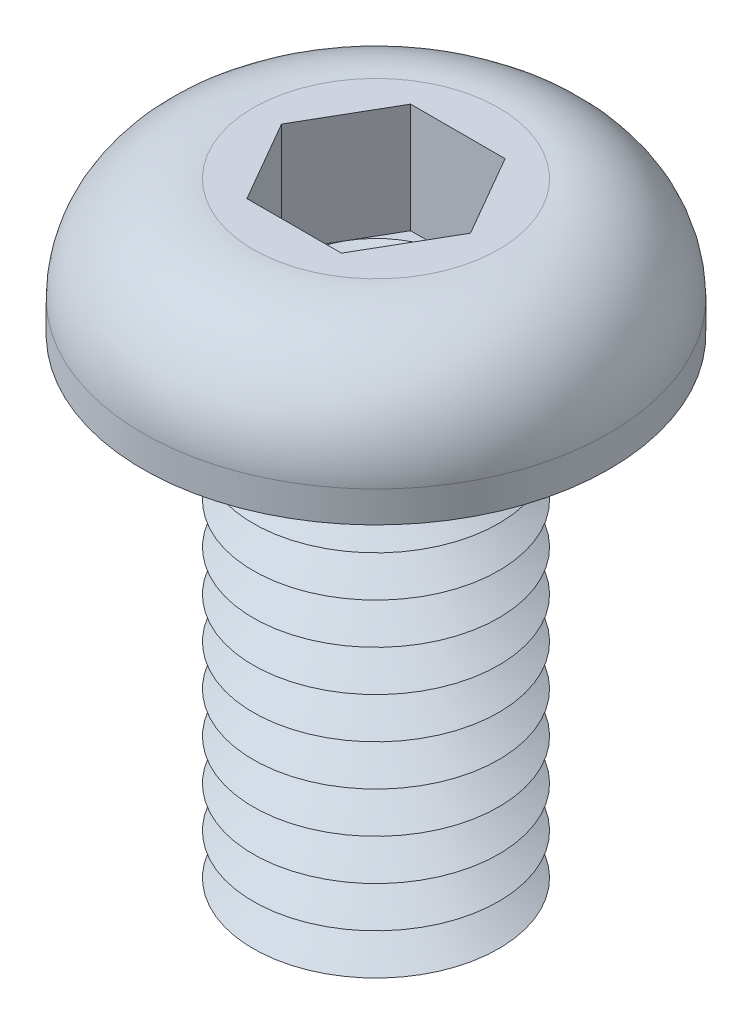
ISO-10303-21;
HEADER;
FILE_DESCRIPTION(('STEP AP214'),'2;1');
FILE_NAME('part.step','',(''),(''),'','','');
FILE_SCHEMA(('AUTOMOTIVE_DESIGN { 1 0 10303 214 1 1 1 1 }'));
ENDSEC;
DATA;
#1=APPLICATION_CONTEXT('core data for automotive mechanical design processes');
#2=APPLICATION_PROTOCOL_DEFINITION('international standard','automotive_design',2000,#1);
#3=PRODUCT_CONTEXT('',#1,'mechanical');
#4=PRODUCT('Part','Part','',(#3));
#5=PRODUCT_RELATED_PRODUCT_CATEGORY('part','',(#4));
#6=PRODUCT_DEFINITION_FORMATION('','',#4);
#7=PRODUCT_DEFINITION_CONTEXT('part definition',#1,'design');
#8=PRODUCT_DEFINITION('design','',#6,#7);
#9=PRODUCT_DEFINITION_SHAPE('','',#8);
#10=(LENGTH_UNIT() NAMED_UNIT(*) SI_UNIT(.MILLI.,.METRE.));
#11=(NAMED_UNIT(*) PLANE_ANGLE_UNIT() SI_UNIT($,.RADIAN.));
#12=(NAMED_UNIT(*) SI_UNIT($,.STERADIAN.) SOLID_ANGLE_UNIT());
#13=UNCERTAINTY_MEASURE_WITH_UNIT(LENGTH_MEASURE(1.E-05),#10,'distance_accuracy_value','');
#14=(GEOMETRIC_REPRESENTATION_CONTEXT(3) GLOBAL_UNCERTAINTY_ASSIGNED_CONTEXT((#13)) GLOBAL_UNIT_ASSIGNED_CONTEXT((#10,
#11,#12)) REPRESENTATION_CONTEXT('',''));
#15=CARTESIAN_POINT('',(0.,0.,0.));
#16=DIRECTION('',(0.,0.,1.));
#17=DIRECTION('',(1.,0.,0.));
#18=AXIS2_PLACEMENT_3D('',#15,#16,#17);
#19=CARTESIAN_POINT('',(0.,0.,0.));
#20=DIRECTION('',(0.,-1.,0.));
#21=DIRECTION('',(0.,0.,-1.));
#22=AXIS2_PLACEMENT_3D('',#19,#20,#21);
#23=TOROIDAL_SURFACE('',#22,1.75,0.25);
#24=CARTESIAN_POINT('',(0.,0.,-2.));
#25=VERTEX_POINT('',#24);
#26=VERTEX_LOOP('',#25);
#27=FACE_BOUND('',#26,.T.);
#28=ADVANCED_FACE('P0_F12',(#27),#23,.T.);
#29=CLOSED_SHELL('',(#28));
#30=MANIFOLD_SOLID_BREP('P0_B1',#29);
#31=CARTESIAN_POINT('',(0.577350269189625,0.31,-1.));
#32=DIRECTION('',(0.,1.,0.));
#33=DIRECTION('',(0.,0.,1.));
#34=AXIS2_PLACEMENT_3D('',#31,#32,#33);
#35=PLANE('',#34);
#36=CARTESIAN_POINT('',(0.,0.31,0.));
#37=DIRECTION('',(0.,1.,0.));
#38=DIRECTION('',(0.,0.,1.));
#39=AXIS2_PLACEMENT_3D('',#36,#37,#38);
#40=CIRCLE('',#39,1.);
#41=CARTESIAN_POINT('',(0.,0.31,1.));
#42=VERTEX_POINT('',#41);
#43=CARTESIAN_POINT('',(0.866025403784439,0.31,0.5));
#44=VERTEX_POINT('',#43);
#45=EDGE_CURVE('P1_E93',#42,#44,#40,.T.);
#46=ORIENTED_EDGE('',*,*,#45,.F.);
#47=DIRECTION('',(1.,0.,0.));
#48=VECTOR('',#47,1.);
#49=CARTESIAN_POINT('',(-0.577350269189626,0.31,1.));
#50=LINE('',#49,#48);
#51=CARTESIAN_POINT('',(0.577350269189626,0.31,1.));
#52=VERTEX_POINT('',#51);
#53=EDGE_CURVE('P1_E116',#42,#52,#50,.T.);
#54=ORIENTED_EDGE('',*,*,#53,.T.);
#55=DIRECTION('',(0.5,0.,-0.866025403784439));
#56=VECTOR('',#55,1.);
#57=CARTESIAN_POINT('',(0.577350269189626,0.31,1.));
#58=LINE('',#57,#56);
#59=EDGE_CURVE('P1_E112',#52,#44,#58,.T.);
#60=ORIENTED_EDGE('',*,*,#59,.T.);
#61=EDGE_LOOP('',(#46,#54,#60));
#62=FACE_BOUND('',#61,.T.);
#63=ADVANCED_FACE('P1_F15',(#62),#35,.T.);
#64=CARTESIAN_POINT('',(0.,0.31,0.));
#65=DIRECTION('',(0.,1.,0.));
#66=DIRECTION('',(0.,0.,1.));
#67=AXIS2_PLACEMENT_3D('',#64,#65,#66);
#68=CIRCLE('',#67,1.);
#69=CARTESIAN_POINT('',(0.866025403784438,0.31,-0.5));
#70=VERTEX_POINT('',#69);
#71=EDGE_CURVE('P1_E10',#44,#70,#68,.T.);
#72=ORIENTED_EDGE('',*,*,#71,.F.);
#73=CARTESIAN_POINT('',(1.15470053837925,0.31,0.));
#74=VERTEX_POINT('',#73);
#75=EDGE_CURVE('P1_E104',#44,#74,#58,.T.);
#76=ORIENTED_EDGE('',*,*,#75,.T.);
#77=DIRECTION('',(-0.5,0.,-0.866025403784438));
#78=VECTOR('',#77,1.);
#79=CARTESIAN_POINT('',(1.15470053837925,0.31,0.));
#80=LINE('',#79,#78);
#81=EDGE_CURVE('P1_E107',#74,#70,#80,.T.);
#82=ORIENTED_EDGE('',*,*,#81,.T.);
#83=EDGE_LOOP('',(#72,#76,#82));
#84=FACE_BOUND('',#83,.T.);
#85=ADVANCED_FACE('P1_F103',(#84),#35,.T.);
#86=CARTESIAN_POINT('',(0.,0.31,-1.));
#87=VERTEX_POINT('',#86);
#88=EDGE_CURVE('P1_E24',#70,#87,#68,.T.);
#89=ORIENTED_EDGE('',*,*,#88,.F.);
#90=CARTESIAN_POINT('',(0.577350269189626,0.31,-1.));
#91=VERTEX_POINT('',#90);
#92=EDGE_CURVE('P1_E139',#70,#91,#80,.T.);
#93=ORIENTED_EDGE('',*,*,#92,.T.);
#94=DIRECTION('',(-1.,0.,0.));
#95=VECTOR('',#94,1.);
#96=CARTESIAN_POINT('',(0.577350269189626,0.31,-1.));
#97=LINE('',#96,#95);
#98=EDGE_CURVE('P1_E288',#91,#87,#97,.T.);
#99=ORIENTED_EDGE('',*,*,#98,.T.);
#100=EDGE_LOOP('',(#89,#93,#99));
#101=FACE_BOUND('',#100,.T.);
#102=ADVANCED_FACE('P1_F253',(#101),#35,.T.);
#103=CARTESIAN_POINT('',(-0.866025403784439,0.31,-0.5));
#104=VERTEX_POINT('',#103);
#105=EDGE_CURVE('P1_E283',#87,#104,#68,.T.);
#106=ORIENTED_EDGE('',*,*,#105,.F.);
#107=CARTESIAN_POINT('',(-0.577350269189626,0.31,-1.));
#108=VERTEX_POINT('',#107);
#109=EDGE_CURVE('P1_E292',#87,#108,#97,.T.);
#110=ORIENTED_EDGE('',*,*,#109,.T.);
#111=DIRECTION('',(-0.5,0.,0.866025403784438));
#112=VECTOR('',#111,1.);
#113=CARTESIAN_POINT('',(-0.577350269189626,0.31,-1.));
#114=LINE('',#113,#112);
#115=EDGE_CURVE('P1_E287',#108,#104,#114,.T.);
#116=ORIENTED_EDGE('',*,*,#115,.T.);
#117=EDGE_LOOP('',(#106,#110,#116));
#118=FACE_BOUND('',#117,.T.);
#119=ADVANCED_FACE('P1_F267',(#118),#35,.T.);
#120=CARTESIAN_POINT('',(-0.866025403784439,0.31,0.5));
#121=VERTEX_POINT('',#120);
#122=EDGE_CURVE('P1_E31',#104,#121,#68,.T.);
#123=ORIENTED_EDGE('',*,*,#122,.F.);
#124=CARTESIAN_POINT('',(-1.15470053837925,0.31,0.));
#125=VERTEX_POINT('',#124);
#126=EDGE_CURVE('P1_E279',#104,#125,#114,.T.);
#127=ORIENTED_EDGE('',*,*,#126,.T.);
#128=DIRECTION('',(0.5,0.,0.866025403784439));
#129=VECTOR('',#128,1.);
#130=CARTESIAN_POINT('',(-1.15470053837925,0.31,0.));
#131=LINE('',#130,#129);
#132=EDGE_CURVE('P1_E282',#125,#121,#131,.T.);
#133=ORIENTED_EDGE('',*,*,#132,.T.);
#134=EDGE_LOOP('',(#123,#127,#133));
#135=FACE_BOUND('',#134,.T.);
#136=ADVANCED_FACE('P1_F258',(#135),#35,.T.);
#137=CARTESIAN_POINT('',(0.,-5.5,0.));
#138=DIRECTION('',(0.,1.,0.));
#139=DIRECTION('',(0.,0.,1.));
#140=AXIS2_PLACEMENT_3D('',#137,#138,#139);
#141=CONICAL_SURFACE('',#140,1.06698729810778,1.0471975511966);
#142=CARTESIAN_POINT('',(0.,-5.25,0.));
#143=DIRECTION('',(0.,-1.,0.));
#144=DIRECTION('',(0.,0.,-1.));
#145=AXIS2_PLACEMENT_3D('',#142,#143,#144);
#146=CIRCLE('',#145,1.5);
#147=CARTESIAN_POINT('',(0.,-5.25,-1.5));
#148=VERTEX_POINT('',#147);
#149=EDGE_CURVE('P1_E215',#148,#148,#146,.T.);
#150=ORIENTED_EDGE('',*,*,#149,.T.);
#151=EDGE_LOOP('',(#150));
#152=FACE_BOUND('',#151,.T.);
#153=CARTESIAN_POINT('',(0.,-5.5,0.));
#154=DIRECTION('',(0.,-1.,0.));
#155=DIRECTION('',(0.,0.,-1.));
#156=AXIS2_PLACEMENT_3D('',#153,#154,#155);
#157=CIRCLE('',#156,1.06698729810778);
#158=CARTESIAN_POINT('',(0.,-5.5,-1.06698729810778));
#159=VERTEX_POINT('',#158);
#160=EDGE_CURVE('P1_E218',#159,#159,#157,.T.);
#161=ORIENTED_EDGE('',*,*,#160,.F.);
#162=EDGE_LOOP('',(#161));
#163=FACE_BOUND('',#162,.T.);
#164=ADVANCED_FACE('P1_F266',(#152,#163),#141,.T.);
#165=CARTESIAN_POINT('',(0.,-5.75,0.));
#166=DIRECTION('',(0.,-1.,0.));
#167=DIRECTION('',(0.,0.,-1.));
#168=AXIS2_PLACEMENT_3D('',#165,#166,#167);
#169=CONICAL_SURFACE('',#168,1.5,1.0471975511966);
#170=ORIENTED_EDGE('',*,*,#160,.T.);
#171=EDGE_LOOP('',(#170));
#172=FACE_BOUND('',#171,.T.);
#173=CARTESIAN_POINT('',(0.,-5.75,0.));
#174=DIRECTION('',(0.,-1.,0.));
#175=DIRECTION('',(0.,0.,-1.));
#176=AXIS2_PLACEMENT_3D('',#173,#174,#175);
#177=CIRCLE('',#176,1.5);
#178=CARTESIAN_POINT('',(0.,-5.75,-1.5));
#179=VERTEX_POINT('',#178);
#180=EDGE_CURVE('P1_E221',#179,#179,#177,.T.);
#181=ORIENTED_EDGE('',*,*,#180,.F.);
#182=EDGE_LOOP('',(#181));
#183=FACE_BOUND('',#182,.T.);
#184=ADVANCED_FACE('P1_F273',(#172,#183),#169,.T.);
#185=CARTESIAN_POINT('',(0.,-6.,0.));
#186=DIRECTION('',(0.,1.,0.));
#187=DIRECTION('',(0.,0.,1.));
#188=AXIS2_PLACEMENT_3D('',#185,#186,#187);
#189=PLANE('',#188);
#190=CARTESIAN_POINT('',(0.,-6.,0.));
#191=DIRECTION('',(0.,-1.,0.));
#192=DIRECTION('',(0.,0.,-1.));
#193=AXIS2_PLACEMENT_3D('',#190,#191,#192);
#194=CIRCLE('',#193,1.06698729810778);
#195=CARTESIAN_POINT('',(0.,-6.,-1.06698729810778));
#196=VERTEX_POINT('',#195);
#197=EDGE_CURVE('P1_E224',#196,#196,#194,.T.);
#198=ORIENTED_EDGE('',*,*,#197,.T.);
#199=EDGE_LOOP('',(#198));
#200=FACE_BOUND('',#199,.T.);
#201=ADVANCED_FACE('P1_F351',(#200),#189,.F.);
#202=CARTESIAN_POINT('',(0.,-6.,0.));
#203=DIRECTION('',(0.,1.,0.));
#204=DIRECTION('',(0.,0.,1.));
#205=AXIS2_PLACEMENT_3D('',#202,#203,#204);
#206=CONICAL_SURFACE('',#205,1.06698729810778,1.0471975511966);
#207=ORIENTED_EDGE('',*,*,#180,.T.);
#208=EDGE_LOOP('',(#207));
#209=FACE_BOUND('',#208,.T.);
#210=ORIENTED_EDGE('',*,*,#197,.F.);
#211=EDGE_LOOP('',(#210));
#212=FACE_BOUND('',#211,.T.);
#213=ADVANCED_FACE('P1_F362',(#209,#212),#206,.T.);
#214=CARTESIAN_POINT('',(0.,-5.,0.));
#215=DIRECTION('',(0.,1.,0.));
#216=DIRECTION('',(0.,0.,1.));
#217=AXIS2_PLACEMENT_3D('',#214,#215,#216);
#218=CONICAL_SURFACE('',#217,1.06698729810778,1.0471975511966);
#219=CARTESIAN_POINT('',(0.,-4.75,0.));
#220=DIRECTION('',(0.,-1.,0.));
#221=DIRECTION('',(0.,0.,-1.));
#222=AXIS2_PLACEMENT_3D('',#219,#220,#221);
#223=CIRCLE('',#222,1.5);
#224=CARTESIAN_POINT('',(0.,-4.75,-1.5));
#225=VERTEX_POINT('',#224);
#226=EDGE_CURVE('P1_E209',#225,#225,#223,.T.);
#227=ORIENTED_EDGE('',*,*,#226,.T.);
#228=EDGE_LOOP('',(#227));
#229=FACE_BOUND('',#228,.T.);
#230=CARTESIAN_POINT('',(0.,-5.,0.));
#231=DIRECTION('',(0.,-1.,0.));
#232=DIRECTION('',(0.,0.,-1.));
#233=AXIS2_PLACEMENT_3D('',#230,#231,#232);
#234=CIRCLE('',#233,1.06698729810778);
#235=CARTESIAN_POINT('',(0.,-5.,-1.06698729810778));
#236=VERTEX_POINT('',#235);
#237=EDGE_CURVE('P1_E212',#236,#236,#234,.T.);
#238=ORIENTED_EDGE('',*,*,#237,.F.);
#239=EDGE_LOOP('',(#238));
#240=FACE_BOUND('',#239,.T.);
#241=ADVANCED_FACE('P1_F371',(#229,#240),#218,.T.);
#242=CARTESIAN_POINT('',(0.,-5.25,0.));
#243=DIRECTION('',(0.,-1.,0.));
#244=DIRECTION('',(0.,0.,-1.));
#245=AXIS2_PLACEMENT_3D('',#242,#243,#244);
#246=CONICAL_SURFACE('',#245,1.5,1.0471975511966);
#247=ORIENTED_EDGE('',*,*,#237,.T.);
#248=EDGE_LOOP('',(#247));
#249=FACE_BOUND('',#248,.T.);
#250=ORIENTED_EDGE('',*,*,#149,.F.);
#251=EDGE_LOOP('',(#250));
#252=FACE_BOUND('',#251,.T.);
#253=ADVANCED_FACE('P1_F380',(#249,#252),#246,.T.);
#254=CARTESIAN_POINT('',(0.,-4.5,0.));
#255=DIRECTION('',(0.,1.,0.));
#256=DIRECTION('',(0.,0.,1.));
#257=AXIS2_PLACEMENT_3D('',#254,#255,#256);
#258=CONICAL_SURFACE('',#257,1.06698729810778,1.0471975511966);
#259=CARTESIAN_POINT('',(0.,-4.25,0.));
#260=DIRECTION('',(0.,-1.,0.));
#261=DIRECTION('',(0.,0.,-1.));
#262=AXIS2_PLACEMENT_3D('',#259,#260,#261);
#263=CIRCLE('',#262,1.5);
#264=CARTESIAN_POINT('',(0.,-4.25,-1.5));
#265=VERTEX_POINT('',#264);
#266=EDGE_CURVE('P1_E203',#265,#265,#263,.T.);
#267=ORIENTED_EDGE('',*,*,#266,.T.);
#268=EDGE_LOOP('',(#267));
#269=FACE_BOUND('',#268,.T.);
#270=CARTESIAN_POINT('',(0.,-4.5,0.));
#271=DIRECTION('',(0.,-1.,0.));
#272=DIRECTION('',(0.,0.,-1.));
#273=AXIS2_PLACEMENT_3D('',#270,#271,#272);
#274=CIRCLE('',#273,1.06698729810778);
#275=CARTESIAN_POINT('',(0.,-4.5,-1.06698729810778));
#276=VERTEX_POINT('',#275);
#277=EDGE_CURVE('P1_E206',#276,#276,#274,.T.);
#278=ORIENTED_EDGE('',*,*,#277,.F.);
#279=EDGE_LOOP('',(#278));
#280=FACE_BOUND('',#279,.T.);
#281=ADVANCED_FACE('P1_F390',(#269,#280),#258,.T.);
#282=CARTESIAN_POINT('',(0.,-4.75,0.));
#283=DIRECTION('',(0.,-1.,0.));
#284=DIRECTION('',(0.,0.,-1.));
#285=AXIS2_PLACEMENT_3D('',#282,#283,#284);
#286=CONICAL_SURFACE('',#285,1.5,1.0471975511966);
#287=ORIENTED_EDGE('',*,*,#277,.T.);
#288=EDGE_LOOP('',(#287));
#289=FACE_BOUND('',#288,.T.);
#290=ORIENTED_EDGE('',*,*,#226,.F.);
#291=EDGE_LOOP('',(#290));
#292=FACE_BOUND('',#291,.T.);
#293=ADVANCED_FACE('P1_F400',(#289,#292),#286,.T.);
#294=CARTESIAN_POINT('',(0.,-4.,0.));
#295=DIRECTION('',(0.,1.,0.));
#296=DIRECTION('',(0.,0.,1.));
#297=AXIS2_PLACEMENT_3D('',#294,#295,#296);
#298=CONICAL_SURFACE('',#297,1.06698729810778,1.0471975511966);
#299=CARTESIAN_POINT('',(0.,-3.75,0.));
#300=DIRECTION('',(0.,-1.,0.));
#301=DIRECTION('',(0.,0.,-1.));
#302=AXIS2_PLACEMENT_3D('',#299,#300,#301);
#303=CIRCLE('',#302,1.5);
#304=CARTESIAN_POINT('',(0.,-3.75,-1.5));
#305=VERTEX_POINT('',#304);
#306=EDGE_CURVE('P1_E197',#305,#305,#303,.T.);
#307=ORIENTED_EDGE('',*,*,#306,.T.);
#308=EDGE_LOOP('',(#307));
#309=FACE_BOUND('',#308,.T.);
#310=CARTESIAN_POINT('',(0.,-4.,0.));
#311=DIRECTION('',(0.,-1.,0.));
#312=DIRECTION('',(0.,0.,-1.));
#313=AXIS2_PLACEMENT_3D('',#310,#311,#312);
#314=CIRCLE('',#313,1.06698729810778);
#315=CARTESIAN_POINT('',(0.,-4.,-1.06698729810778));
#316=VERTEX_POINT('',#315);
#317=EDGE_CURVE('P1_E200',#316,#316,#314,.T.);
#318=ORIENTED_EDGE('',*,*,#317,.F.);
#319=EDGE_LOOP('',(#318));
#320=FACE_BOUND('',#319,.T.);
#321=ADVANCED_FACE('P1_F410',(#309,#320),#298,.T.);
#322=CARTESIAN_POINT('',(0.,-4.25,0.));
#323=DIRECTION('',(0.,-1.,0.));
#324=DIRECTION('',(0.,0.,-1.));
#325=AXIS2_PLACEMENT_3D('',#322,#323,#324);
#326=CONICAL_SURFACE('',#325,1.5,1.0471975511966);
#327=ORIENTED_EDGE('',*,*,#317,.T.);
#328=EDGE_LOOP('',(#327));
#329=FACE_BOUND('',#328,.T.);
#330=ORIENTED_EDGE('',*,*,#266,.F.);
#331=EDGE_LOOP('',(#330));
#332=FACE_BOUND('',#331,.T.);
#333=ADVANCED_FACE('P1_F420',(#329,#332),#326,.T.);
#334=CARTESIAN_POINT('',(0.,-3.5,0.));
#335=DIRECTION('',(0.,1.,0.));
#336=DIRECTION('',(0.,0.,1.));
#337=AXIS2_PLACEMENT_3D('',#334,#335,#336);
#338=CONICAL_SURFACE('',#337,1.06698729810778,1.0471975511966);
#339=CARTESIAN_POINT('',(0.,-3.25,0.));
#340=DIRECTION('',(0.,-1.,0.));
#341=DIRECTION('',(0.,0.,-1.));
#342=AXIS2_PLACEMENT_3D('',#339,#340,#341);
#343=CIRCLE('',#342,1.5);
#344=CARTESIAN_POINT('',(0.,-3.25,-1.5));
#345=VERTEX_POINT('',#344);
#346=EDGE_CURVE('P1_E191',#345,#345,#343,.T.);
#347=ORIENTED_EDGE('',*,*,#346,.T.);
#348=EDGE_LOOP('',(#347));
#349=FACE_BOUND('',#348,.T.);
#350=CARTESIAN_POINT('',(0.,-3.5,0.));
#351=DIRECTION('',(0.,-1.,0.));
#352=DIRECTION('',(0.,0.,-1.));
#353=AXIS2_PLACEMENT_3D('',#350,#351,#352);
#354=CIRCLE('',#353,1.06698729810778);
#355=CARTESIAN_POINT('',(0.,-3.5,-1.06698729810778));
#356=VERTEX_POINT('',#355);
#357=EDGE_CURVE('P1_E194',#356,#356,#354,.T.);
#358=ORIENTED_EDGE('',*,*,#357,.F.);
#359=EDGE_LOOP('',(#358));
#360=FACE_BOUND('',#359,.T.);
#361=ADVANCED_FACE('P1_F430',(#349,#360),#338,.T.);
#362=CARTESIAN_POINT('',(0.,-3.75,0.));
#363=DIRECTION('',(0.,-1.,0.));
#364=DIRECTION('',(0.,0.,-1.));
#365=AXIS2_PLACEMENT_3D('',#362,#363,#364);
#366=CONICAL_SURFACE('',#365,1.5,1.0471975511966);
#367=ORIENTED_EDGE('',*,*,#357,.T.);
#368=EDGE_LOOP('',(#367));
#369=FACE_BOUND('',#368,.T.);
#370=ORIENTED_EDGE('',*,*,#306,.F.);
#371=EDGE_LOOP('',(#370));
#372=FACE_BOUND('',#371,.T.);
#373=ADVANCED_FACE('P1_F440',(#369,#372),#366,.T.);
#374=CARTESIAN_POINT('',(0.,-3.,0.));
#375=DIRECTION('',(0.,1.,0.));
#376=DIRECTION('',(0.,0.,1.));
#377=AXIS2_PLACEMENT_3D('',#374,#375,#376);
#378=CONICAL_SURFACE('',#377,1.06698729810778,1.0471975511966);
#379=CARTESIAN_POINT('',(0.,-2.75,0.));
#380=DIRECTION('',(0.,-1.,0.));
#381=DIRECTION('',(0.,0.,-1.));
#382=AXIS2_PLACEMENT_3D('',#379,#380,#381);
#383=CIRCLE('',#382,1.5);
#384=CARTESIAN_POINT('',(0.,-2.75,-1.5));
#385=VERTEX_POINT('',#384);
#386=EDGE_CURVE('P1_E185',#385,#385,#383,.T.);
#387=ORIENTED_EDGE('',*,*,#386,.T.);
#388=EDGE_LOOP('',(#387));
#389=FACE_BOUND('',#388,.T.);
#390=CARTESIAN_POINT('',(0.,-3.,0.));
#391=DIRECTION('',(0.,-1.,0.));
#392=DIRECTION('',(0.,0.,-1.));
#393=AXIS2_PLACEMENT_3D('',#390,#391,#392);
#394=CIRCLE('',#393,1.06698729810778);
#395=CARTESIAN_POINT('',(0.,-3.,-1.06698729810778));
#396=VERTEX_POINT('',#395);
#397=EDGE_CURVE('P1_E188',#396,#396,#394,.T.);
#398=ORIENTED_EDGE('',*,*,#397,.F.);
#399=EDGE_LOOP('',(#398));
#400=FACE_BOUND('',#399,.T.);
#401=ADVANCED_FACE('P1_F450',(#389,#400),#378,.T.);
#402=CARTESIAN_POINT('',(0.,-3.25,0.));
#403=DIRECTION('',(0.,-1.,0.));
#404=DIRECTION('',(0.,0.,-1.));
#405=AXIS2_PLACEMENT_3D('',#402,#403,#404);
#406=CONICAL_SURFACE('',#405,1.5,1.0471975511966);
#407=ORIENTED_EDGE('',*,*,#397,.T.);
#408=EDGE_LOOP('',(#407));
#409=FACE_BOUND('',#408,.T.);
#410=ORIENTED_EDGE('',*,*,#346,.F.);
#411=EDGE_LOOP('',(#410));
#412=FACE_BOUND('',#411,.T.);
#413=ADVANCED_FACE('P1_F460',(#409,#412),#406,.T.);
#414=CARTESIAN_POINT('',(0.,-2.5,0.));
#415=DIRECTION('',(0.,1.,0.));
#416=DIRECTION('',(0.,0.,1.));
#417=AXIS2_PLACEMENT_3D('',#414,#415,#416);
#418=CONICAL_SURFACE('',#417,1.06698729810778,1.0471975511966);
#419=CARTESIAN_POINT('',(0.,-2.25,0.));
#420=DIRECTION('',(0.,-1.,0.));
#421=DIRECTION('',(0.,0.,-1.));
#422=AXIS2_PLACEMENT_3D('',#419,#420,#421);
#423=CIRCLE('',#422,1.5);
#424=CARTESIAN_POINT('',(0.,-2.25,-1.5));
#425=VERTEX_POINT('',#424);
#426=EDGE_CURVE('P1_E179',#425,#425,#423,.T.);
#427=ORIENTED_EDGE('',*,*,#426,.T.);
#428=EDGE_LOOP('',(#427));
#429=FACE_BOUND('',#428,.T.);
#430=CARTESIAN_POINT('',(0.,-2.5,0.));
#431=DIRECTION('',(0.,-1.,0.));
#432=DIRECTION('',(0.,0.,-1.));
#433=AXIS2_PLACEMENT_3D('',#430,#431,#432);
#434=CIRCLE('',#433,1.06698729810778);
#435=CARTESIAN_POINT('',(0.,-2.5,-1.06698729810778));
#436=VERTEX_POINT('',#435);
#437=EDGE_CURVE('P1_E182',#436,#436,#434,.T.);
#438=ORIENTED_EDGE('',*,*,#437,.F.);
#439=EDGE_LOOP('',(#438));
#440=FACE_BOUND('',#439,.T.);
#441=ADVANCED_FACE('P1_F470',(#429,#440),#418,.T.);
#442=CARTESIAN_POINT('',(0.,-2.75,0.));
#443=DIRECTION('',(0.,-1.,0.));
#444=DIRECTION('',(0.,0.,-1.));
#445=AXIS2_PLACEMENT_3D('',#442,#443,#444);
#446=CONICAL_SURFACE('',#445,1.5,1.0471975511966);
#447=ORIENTED_EDGE('',*,*,#437,.T.);
#448=EDGE_LOOP('',(#447));
#449=FACE_BOUND('',#448,.T.);
#450=ORIENTED_EDGE('',*,*,#386,.F.);
#451=EDGE_LOOP('',(#450));
#452=FACE_BOUND('',#451,.T.);
#453=ADVANCED_FACE('P1_F480',(#449,#452),#446,.T.);
#454=CARTESIAN_POINT('',(0.,-2.,0.));
#455=DIRECTION('',(0.,1.,0.));
#456=DIRECTION('',(0.,0.,1.));
#457=AXIS2_PLACEMENT_3D('',#454,#455,#456);
#458=CONICAL_SURFACE('',#457,1.06698729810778,1.0471975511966);
#459=CARTESIAN_POINT('',(0.,-1.75,0.));
#460=DIRECTION('',(0.,-1.,0.));
#461=DIRECTION('',(0.,0.,-1.));
#462=AXIS2_PLACEMENT_3D('',#459,#460,#461);
#463=CIRCLE('',#462,1.5);
#464=CARTESIAN_POINT('',(0.,-1.75,-1.5));
#465=VERTEX_POINT('',#464);
#466=EDGE_CURVE('P1_E173',#465,#465,#463,.T.);
#467=ORIENTED_EDGE('',*,*,#466,.T.);
#468=EDGE_LOOP('',(#467));
#469=FACE_BOUND('',#468,.T.);
#470=CARTESIAN_POINT('',(0.,-2.,0.));
#471=DIRECTION('',(0.,-1.,0.));
#472=DIRECTION('',(0.,0.,-1.));
#473=AXIS2_PLACEMENT_3D('',#470,#471,#472);
#474=CIRCLE('',#473,1.06698729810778);
#475=CARTESIAN_POINT('',(0.,-2.,-1.06698729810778));
#476=VERTEX_POINT('',#475);
#477=EDGE_CURVE('P1_E176',#476,#476,#474,.T.);
#478=ORIENTED_EDGE('',*,*,#477,.F.);
#479=EDGE_LOOP('',(#478));
#480=FACE_BOUND('',#479,.T.);
#481=ADVANCED_FACE('P1_F490',(#469,#480),#458,.T.);
#482=CARTESIAN_POINT('',(0.,-2.25,0.));
#483=DIRECTION('',(0.,-1.,0.));
#484=DIRECTION('',(0.,0.,-1.));
#485=AXIS2_PLACEMENT_3D('',#482,#483,#484);
#486=CONICAL_SURFACE('',#485,1.5,1.0471975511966);
#487=ORIENTED_EDGE('',*,*,#477,.T.);
#488=EDGE_LOOP('',(#487));
#489=FACE_BOUND('',#488,.T.);
#490=ORIENTED_EDGE('',*,*,#426,.F.);
#491=EDGE_LOOP('',(#490));
#492=FACE_BOUND('',#491,.T.);
#493=ADVANCED_FACE('P1_F500',(#489,#492),#486,.T.);
#494=CARTESIAN_POINT('',(0.,-1.5,0.));
#495=DIRECTION('',(0.,1.,0.));
#496=DIRECTION('',(0.,0.,1.));
#497=AXIS2_PLACEMENT_3D('',#494,#495,#496);
#498=CONICAL_SURFACE('',#497,1.06698729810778,1.0471975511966);
#499=CARTESIAN_POINT('',(0.,-1.25,0.));
#500=DIRECTION('',(0.,-1.,0.));
#501=DIRECTION('',(0.,0.,-1.));
#502=AXIS2_PLACEMENT_3D('',#499,#500,#501);
#503=CIRCLE('',#502,1.5);
#504=CARTESIAN_POINT('',(0.,-1.25,-1.5));
#505=VERTEX_POINT('',#504);
#506=EDGE_CURVE('P1_E164',#505,#505,#503,.T.);
#507=ORIENTED_EDGE('',*,*,#506,.T.);
#508=EDGE_LOOP('',(#507));
#509=FACE_BOUND('',#508,.T.);
#510=CARTESIAN_POINT('',(0.,-1.5,0.));
#511=DIRECTION('',(0.,-1.,0.));
#512=DIRECTION('',(0.,0.,-1.));
#513=AXIS2_PLACEMENT_3D('',#510,#511,#512);
#514=CIRCLE('',#513,1.06698729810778);
#515=CARTESIAN_POINT('',(0.,-1.5,-1.06698729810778));
#516=VERTEX_POINT('',#515);
#517=EDGE_CURVE('P1_E170',#516,#516,#514,.T.);
#518=ORIENTED_EDGE('',*,*,#517,.F.);
#519=EDGE_LOOP('',(#518));
#520=FACE_BOUND('',#519,.T.);
#521=ADVANCED_FACE('P1_F510',(#509,#520),#498,.T.);
#522=CARTESIAN_POINT('',(0.,-1.75,0.));
#523=DIRECTION('',(0.,-1.,0.));
#524=DIRECTION('',(0.,0.,-1.));
#525=AXIS2_PLACEMENT_3D('',#522,#523,#524);
#526=CONICAL_SURFACE('',#525,1.5,1.0471975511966);
#527=ORIENTED_EDGE('',*,*,#517,.T.);
#528=EDGE_LOOP('',(#527));
#529=FACE_BOUND('',#528,.T.);
#530=ORIENTED_EDGE('',*,*,#466,.F.);
#531=EDGE_LOOP('',(#530));
#532=FACE_BOUND('',#531,.T.);
#533=ADVANCED_FACE('P1_F520',(#529,#532),#526,.T.);
#534=CARTESIAN_POINT('',(0.,-1.,0.));
#535=DIRECTION('',(0.,1.,0.));
#536=DIRECTION('',(0.,0.,1.));
#537=AXIS2_PLACEMENT_3D('',#534,#535,#536);
#538=CONICAL_SURFACE('',#537,1.06698729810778,1.0471975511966);
#539=CARTESIAN_POINT('',(0.,-0.75,0.));
#540=DIRECTION('',(0.,-1.,0.));
#541=DIRECTION('',(0.,0.,-1.));
#542=AXIS2_PLACEMENT_3D('',#539,#540,#541);
#543=CIRCLE('',#542,1.5);
#544=CARTESIAN_POINT('',(0.,-0.75,-1.5));
#545=VERTEX_POINT('',#544);
#546=EDGE_CURVE('P1_E167',#545,#545,#543,.T.);
#547=ORIENTED_EDGE('',*,*,#546,.T.);
#548=EDGE_LOOP('',(#547));
#549=FACE_BOUND('',#548,.T.);
#550=CARTESIAN_POINT('',(0.,-1.,0.));
#551=DIRECTION('',(0.,-1.,0.));
#552=DIRECTION('',(0.,0.,-1.));
#553=AXIS2_PLACEMENT_3D('',#550,#551,#552);
#554=CIRCLE('',#553,1.06698729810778);
#555=CARTESIAN_POINT('',(0.,-1.,-1.06698729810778));
#556=VERTEX_POINT('',#555);
#557=EDGE_CURVE('P1_E161',#556,#556,#554,.T.);
#558=ORIENTED_EDGE('',*,*,#557,.F.);
#559=EDGE_LOOP('',(#558));
#560=FACE_BOUND('',#559,.T.);
#561=ADVANCED_FACE('P1_F530',(#549,#560),#538,.T.);
#562=CARTESIAN_POINT('',(0.,-1.25,0.));
#563=DIRECTION('',(0.,-1.,0.));
#564=DIRECTION('',(0.,0.,-1.));
#565=AXIS2_PLACEMENT_3D('',#562,#563,#564);
#566=CONICAL_SURFACE('',#565,1.5,1.0471975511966);
#567=ORIENTED_EDGE('',*,*,#557,.T.);
#568=EDGE_LOOP('',(#567));
#569=FACE_BOUND('',#568,.T.);
#570=ORIENTED_EDGE('',*,*,#506,.F.);
#571=EDGE_LOOP('',(#570));
#572=FACE_BOUND('',#571,.T.);
#573=ADVANCED_FACE('P1_F540',(#569,#572),#566,.T.);
#574=CARTESIAN_POINT('',(0.,-6.,0.));
#575=DIRECTION('',(0.,1.,0.));
#576=DIRECTION('',(0.,0.,1.));
#577=AXIS2_PLACEMENT_3D('',#574,#575,#576);
#578=CYLINDRICAL_SURFACE('',#577,1.5);
#579=CARTESIAN_POINT('',(0.,0.,0.));
#580=DIRECTION('',(0.,-1.,0.));
#581=DIRECTION('',(1.,0.,0.));
#582=AXIS2_PLACEMENT_3D('',#579,#580,#581);
#583=CIRCLE('',#582,1.5);
#584=CARTESIAN_POINT('',(1.5,0.,0.));
#585=VERTEX_POINT('',#584);
#586=EDGE_CURVE('P1_E141',#585,#585,#583,.F.);
#587=ORIENTED_EDGE('',*,*,#586,.F.);
#588=EDGE_LOOP('',(#587));
#589=FACE_BOUND('',#588,.T.);
#590=ORIENTED_EDGE('',*,*,#546,.F.);
#591=EDGE_LOOP('',(#590));
#592=FACE_BOUND('',#591,.T.);
#593=ADVANCED_FACE('P1_F17',(#589,#592),#578,.T.);
#594=CARTESIAN_POINT('',(0.,0.,0.));
#595=DIRECTION('',(0.,-1.,0.));
#596=DIRECTION('',(0.,0.,-1.));
#597=AXIS2_PLACEMENT_3D('',#594,#595,#596);
#598=TOROIDAL_SURFACE('',#597,1.75,0.25);
#599=ORIENTED_EDGE('',*,*,#586,.T.);
#600=EDGE_LOOP('',(#599));
#601=FACE_BOUND('',#600,.T.);
#602=CARTESIAN_POINT('',(0.,0.,0.));
#603=DIRECTION('',(0.,1.,0.));
#604=DIRECTION('',(-1.,0.,0.));
#605=AXIS2_PLACEMENT_3D('',#602,#603,#604);
#606=CIRCLE('',#605,2.);
#607=CARTESIAN_POINT('',(-2.,0.,0.));
#608=VERTEX_POINT('',#607);
#609=EDGE_CURVE('P1_E151',#608,#608,#606,.F.);
#610=ORIENTED_EDGE('',*,*,#609,.T.);
#611=EDGE_LOOP('',(#610));
#612=FACE_BOUND('',#611,.T.);
#613=ADVANCED_FACE('P1_F229',(#601,#612),#598,.F.);
#614=CARTESIAN_POINT('',(1.5,1.65,0.));
#615=DIRECTION('',(0.,-1.,0.));
#616=DIRECTION('',(1.,0.,0.));
#617=AXIS2_PLACEMENT_3D('',#614,#615,#616);
#618=PLANE('',#617);
#619=DIRECTION('',(-1.,0.,0.));
#620=VECTOR('',#619,1.);
#621=CARTESIAN_POINT('',(0.577350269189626,1.65,-1.));
#622=LINE('',#621,#620);
#623=CARTESIAN_POINT('',(0.577350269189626,1.65,-1.));
#624=VERTEX_POINT('',#623);
#625=CARTESIAN_POINT('',(-0.577350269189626,1.65,-1.));
#626=VERTEX_POINT('',#625);
#627=EDGE_CURVE('P1_E125',#624,#626,#622,.T.);
#628=ORIENTED_EDGE('',*,*,#627,.F.);
#629=DIRECTION('',(-0.5,0.,-0.866025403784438));
#630=VECTOR('',#629,1.);
#631=CARTESIAN_POINT('',(1.15470053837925,1.65,0.));
#632=LINE('',#631,#630);
#633=CARTESIAN_POINT('',(1.15470053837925,1.65,0.));
#634=VERTEX_POINT('',#633);
#635=EDGE_CURVE('P1_E39',#634,#624,#632,.T.);
#636=ORIENTED_EDGE('',*,*,#635,.F.);
#637=DIRECTION('',(0.5,0.,-0.866025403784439));
#638=VECTOR('',#637,1.);
#639=CARTESIAN_POINT('',(0.577350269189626,1.65,1.));
#640=LINE('',#639,#638);
#641=CARTESIAN_POINT('',(0.577350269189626,1.65,1.));
#642=VERTEX_POINT('',#641);
#643=EDGE_CURVE('P1_E137',#642,#634,#640,.T.);
#644=ORIENTED_EDGE('',*,*,#643,.F.);
#645=DIRECTION('',(1.,0.,0.));
#646=VECTOR('',#645,1.);
#647=CARTESIAN_POINT('',(-0.577350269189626,1.65,1.));
#648=LINE('',#647,#646);
#649=CARTESIAN_POINT('',(-0.577350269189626,1.65,1.));
#650=VERTEX_POINT('',#649);
#651=EDGE_CURVE('P1_E134',#650,#642,#648,.T.);
#652=ORIENTED_EDGE('',*,*,#651,.F.);
#653=DIRECTION('',(0.5,0.,0.866025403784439));
#654=VECTOR('',#653,1.);
#655=CARTESIAN_POINT('',(-1.15470053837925,1.65,0.));
#656=LINE('',#655,#654);
#657=CARTESIAN_POINT('',(-1.15470053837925,1.65,0.));
#658=VERTEX_POINT('',#657);
#659=EDGE_CURVE('P1_E131',#658,#650,#656,.T.);
#660=ORIENTED_EDGE('',*,*,#659,.F.);
#661=DIRECTION('',(-0.5,0.,0.866025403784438));
#662=VECTOR('',#661,1.);
#663=CARTESIAN_POINT('',(-0.577350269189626,1.65,-1.));
#664=LINE('',#663,#662);
#665=EDGE_CURVE('P1_E128',#626,#658,#664,.T.);
#666=ORIENTED_EDGE('',*,*,#665,.F.);
#667=EDGE_LOOP('',(#628,#636,#644,#652,#660,#666));
#668=FACE_BOUND('',#667,.T.);
#669=CARTESIAN_POINT('',(0.,1.65,0.));
#670=DIRECTION('',(0.,1.,0.));
#671=DIRECTION('',(-1.,0.,0.));
#672=AXIS2_PLACEMENT_3D('',#669,#670,#671);
#673=CIRCLE('',#672,1.5);
#674=CARTESIAN_POINT('',(-1.5,1.65,0.));
#675=VERTEX_POINT('',#674);
#676=EDGE_CURVE('P1_E152',#675,#675,#673,.T.);
#677=ORIENTED_EDGE('',*,*,#676,.T.);
#678=EDGE_LOOP('',(#677));
#679=FACE_BOUND('',#678,.T.);
#680=ADVANCED_FACE('P1_F307',(#668,#679),#618,.F.);
#681=CARTESIAN_POINT('',(0.,0.38,0.));
#682=DIRECTION('',(0.,1.,0.));
#683=DIRECTION('',(-1.,0.,0.));
#684=AXIS2_PLACEMENT_3D('',#681,#682,#683);
#685=TOROIDAL_SURFACE('',#684,1.57762962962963,1.27237037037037);
#686=ORIENTED_EDGE('',*,*,#676,.F.);
#687=EDGE_LOOP('',(#686));
#688=FACE_BOUND('',#687,.T.);
#689=CARTESIAN_POINT('',(0.,0.38,0.));
#690=DIRECTION('',(0.,1.,0.));
#691=DIRECTION('',(-1.,0.,0.));
#692=AXIS2_PLACEMENT_3D('',#689,#690,#691);
#693=CIRCLE('',#692,2.85);
#694=CARTESIAN_POINT('',(-2.85,0.38,0.));
#695=VERTEX_POINT('',#694);
#696=EDGE_CURVE('P1_E155',#695,#695,#693,.T.);
#697=ORIENTED_EDGE('',*,*,#696,.T.);
#698=EDGE_LOOP('',(#697));
#699=FACE_BOUND('',#698,.T.);
#700=ADVANCED_FACE('P1_F243',(#688,#699),#685,.T.);
#701=CARTESIAN_POINT('',(0.,1.65,0.));
#702=DIRECTION('',(0.,1.,0.));
#703=DIRECTION('',(-1.,0.,0.));
#704=AXIS2_PLACEMENT_3D('',#701,#702,#703);
#705=CYLINDRICAL_SURFACE('',#704,2.85);
#706=ORIENTED_EDGE('',*,*,#696,.F.);
#707=EDGE_LOOP('',(#706));
#708=FACE_BOUND('',#707,.T.);
#709=CARTESIAN_POINT('',(0.,0.,0.));
#710=DIRECTION('',(0.,1.,0.));
#711=DIRECTION('',(-1.,0.,0.));
#712=AXIS2_PLACEMENT_3D('',#709,#710,#711);
#713=CIRCLE('',#712,2.85);
#714=CARTESIAN_POINT('',(-2.85,0.,0.));
#715=VERTEX_POINT('',#714);
#716=EDGE_CURVE('P1_E158',#715,#715,#713,.T.);
#717=ORIENTED_EDGE('',*,*,#716,.T.);
#718=EDGE_LOOP('',(#717));
#719=FACE_BOUND('',#718,.T.);
#720=ADVANCED_FACE('P1_F234',(#708,#719),#705,.T.);
#721=CARTESIAN_POINT('',(0.,0.,0.));
#722=DIRECTION('',(0.,1.,0.));
#723=DIRECTION('',(-1.,0.,0.));
#724=AXIS2_PLACEMENT_3D('',#721,#722,#723);
#725=PLANE('',#724);
#726=ORIENTED_EDGE('',*,*,#716,.F.);
#727=EDGE_LOOP('',(#726));
#728=FACE_BOUND('',#727,.T.);
#729=ORIENTED_EDGE('',*,*,#609,.F.);
#730=EDGE_LOOP('',(#729));
#731=FACE_BOUND('',#730,.T.);
#732=ADVANCED_FACE('P1_F231',(#728,#731),#725,.F.);
#733=CARTESIAN_POINT('',(1.15470053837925,0.31,0.));
#734=DIRECTION('',(0.866025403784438,0.,-0.5));
#735=DIRECTION('',(-0.5,0.,-0.866025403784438));
#736=AXIS2_PLACEMENT_3D('',#733,#734,#735);
#737=PLANE('',#736);
#738=ORIENTED_EDGE('',*,*,#635,.T.);
#739=DIRECTION('',(0.,1.,0.));
#740=VECTOR('',#739,1.);
#741=CARTESIAN_POINT('',(0.577350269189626,0.31,-1.));
#742=LINE('',#741,#740);
#743=EDGE_CURVE('P1_E118',#91,#624,#742,.T.);
#744=ORIENTED_EDGE('',*,*,#743,.F.);
#745=ORIENTED_EDGE('',*,*,#92,.F.);
#746=ORIENTED_EDGE('',*,*,#81,.F.);
#747=DIRECTION('',(0.,1.,0.));
#748=VECTOR('',#747,1.);
#749=CARTESIAN_POINT('',(1.15470053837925,0.31,0.));
#750=LINE('',#749,#748);
#751=EDGE_CURVE('P1_E113',#74,#634,#750,.T.);
#752=ORIENTED_EDGE('',*,*,#751,.T.);
#753=EDGE_LOOP('',(#738,#744,#745,#746,#752));
#754=FACE_BOUND('',#753,.T.);
#755=ADVANCED_FACE('P1_F233',(#754),#737,.F.);
#756=CARTESIAN_POINT('',(0.577350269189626,0.31,1.));
#757=DIRECTION('',(0.866025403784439,0.,0.5));
#758=DIRECTION('',(0.5,0.,-0.866025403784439));
#759=AXIS2_PLACEMENT_3D('',#756,#757,#758);
#760=PLANE('',#759);
#761=ORIENTED_EDGE('',*,*,#643,.T.);
#762=ORIENTED_EDGE('',*,*,#751,.F.);
#763=ORIENTED_EDGE('',*,*,#75,.F.);
#764=ORIENTED_EDGE('',*,*,#59,.F.);
#765=DIRECTION('',(0.,1.,0.));
#766=VECTOR('',#765,1.);
#767=CARTESIAN_POINT('',(0.577350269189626,0.31,1.));
#768=LINE('',#767,#766);
#769=EDGE_CURVE('P1_E142',#52,#642,#768,.T.);
#770=ORIENTED_EDGE('',*,*,#769,.T.);
#771=EDGE_LOOP('',(#761,#762,#763,#764,#770));
#772=FACE_BOUND('',#771,.T.);
#773=ADVANCED_FACE('P1_F111',(#772),#760,.F.);
#774=CARTESIAN_POINT('',(-0.577350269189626,0.31,1.));
#775=DIRECTION('',(0.,0.,1.));
#776=DIRECTION('',(1.,0.,0.));
#777=AXIS2_PLACEMENT_3D('',#774,#775,#776);
#778=PLANE('',#777);
#779=ORIENTED_EDGE('',*,*,#651,.T.);
#780=ORIENTED_EDGE('',*,*,#769,.F.);
#781=ORIENTED_EDGE('',*,*,#53,.F.);
#782=CARTESIAN_POINT('',(-0.577350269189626,0.31,1.));
#783=VERTEX_POINT('',#782);
#784=EDGE_CURVE('P1_E114',#783,#42,#50,.T.);
#785=ORIENTED_EDGE('',*,*,#784,.F.);
#786=DIRECTION('',(0.,1.,0.));
#787=VECTOR('',#786,1.);
#788=CARTESIAN_POINT('',(-0.577350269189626,0.31,1.));
#789=LINE('',#788,#787);
#790=EDGE_CURVE('P1_E144',#783,#650,#789,.T.);
#791=ORIENTED_EDGE('',*,*,#790,.T.);
#792=EDGE_LOOP('',(#779,#780,#781,#785,#791));
#793=FACE_BOUND('',#792,.T.);
#794=ADVANCED_FACE('P1_F302',(#793),#778,.F.);
#795=CARTESIAN_POINT('',(-1.15470053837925,0.31,0.));
#796=DIRECTION('',(-0.866025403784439,0.,0.5));
#797=DIRECTION('',(0.5,0.,0.866025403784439));
#798=AXIS2_PLACEMENT_3D('',#795,#796,#797);
#799=PLANE('',#798);
#800=ORIENTED_EDGE('',*,*,#659,.T.);
#801=ORIENTED_EDGE('',*,*,#790,.F.);
#802=EDGE_CURVE('P1_E294',#121,#783,#131,.T.);
#803=ORIENTED_EDGE('',*,*,#802,.F.);
#804=ORIENTED_EDGE('',*,*,#132,.F.);
#805=DIRECTION('',(0.,1.,0.));
#806=VECTOR('',#805,1.);
#807=CARTESIAN_POINT('',(-1.15470053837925,0.31,0.));
#808=LINE('',#807,#806);
#809=EDGE_CURVE('P1_E146',#125,#658,#808,.T.);
#810=ORIENTED_EDGE('',*,*,#809,.T.);
#811=EDGE_LOOP('',(#800,#801,#803,#804,#810));
#812=FACE_BOUND('',#811,.T.);
#813=ADVANCED_FACE('P1_F618',(#812),#799,.F.);
#814=CARTESIAN_POINT('',(-0.577350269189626,0.31,-1.));
#815=DIRECTION('',(-0.866025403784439,0.,-0.5));
#816=DIRECTION('',(-0.5,0.,0.866025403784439));
#817=AXIS2_PLACEMENT_3D('',#814,#815,#816);
#818=PLANE('',#817);
#819=ORIENTED_EDGE('',*,*,#665,.T.);
#820=ORIENTED_EDGE('',*,*,#809,.F.);
#821=ORIENTED_EDGE('',*,*,#126,.F.);
#822=ORIENTED_EDGE('',*,*,#115,.F.);
#823=DIRECTION('',(0.,1.,0.));
#824=VECTOR('',#823,1.);
#825=CARTESIAN_POINT('',(-0.577350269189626,0.31,-1.));
#826=LINE('',#825,#824);
#827=EDGE_CURVE('P1_E119',#108,#626,#826,.T.);
#828=ORIENTED_EDGE('',*,*,#827,.T.);
#829=EDGE_LOOP('',(#819,#820,#821,#822,#828));
#830=FACE_BOUND('',#829,.T.);
#831=ADVANCED_FACE('P1_F262',(#830),#818,.F.);
#832=CARTESIAN_POINT('',(0.577350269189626,0.31,-1.));
#833=DIRECTION('',(0.,0.,-1.));
#834=DIRECTION('',(-1.,0.,0.));
#835=AXIS2_PLACEMENT_3D('',#832,#833,#834);
#836=PLANE('',#835);
#837=ORIENTED_EDGE('',*,*,#627,.T.);
#838=ORIENTED_EDGE('',*,*,#827,.F.);
#839=ORIENTED_EDGE('',*,*,#109,.F.);
#840=ORIENTED_EDGE('',*,*,#98,.F.);
#841=ORIENTED_EDGE('',*,*,#743,.T.);
#842=EDGE_LOOP('',(#837,#838,#839,#840,#841));
#843=FACE_BOUND('',#842,.T.);
#844=ADVANCED_FACE('P1_F256',(#843),#836,.F.);
#845=EDGE_CURVE('P1_E19',#121,#42,#68,.T.);
#846=ORIENTED_EDGE('',*,*,#845,.F.);
#847=ORIENTED_EDGE('',*,*,#802,.T.);
#848=ORIENTED_EDGE('',*,*,#784,.T.);
#849=EDGE_LOOP('',(#846,#847,#848));
#850=FACE_BOUND('',#849,.T.);
#851=ADVANCED_FACE('P1_F90',(#850),#35,.T.);
#852=CARTESIAN_POINT('',(0.,0.31,0.));
#853=DIRECTION('',(0.,1.,0.));
#854=DIRECTION('',(0.,0.,1.));
#855=AXIS2_PLACEMENT_3D('',#852,#853,#854);
#856=CONICAL_SURFACE('',#855,1.,1.0471975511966);
#857=CARTESIAN_POINT('',(0.,-0.267350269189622,0.));
#858=VERTEX_POINT('',#857);
#859=VERTEX_LOOP('',#858);
#860=FACE_BOUND('',#859,.T.);
#861=ORIENTED_EDGE('',*,*,#45,.T.);
#862=ORIENTED_EDGE('',*,*,#71,.T.);
#863=ORIENTED_EDGE('',*,*,#88,.T.);
#864=ORIENTED_EDGE('',*,*,#105,.T.);
#865=ORIENTED_EDGE('',*,*,#122,.T.);
#866=ORIENTED_EDGE('',*,*,#845,.T.);
#867=EDGE_LOOP('',(#861,#862,#863,#864,#865,#866));
#868=FACE_BOUND('',#867,.T.);
#869=ADVANCED_FACE('P1_F88',(#860,#868),#856,.F.);
#870=CLOSED_SHELL('',(#63,#85,#102,#119,#136,#164,#184,#201,#213,#241,#253,#281,#293,#321,#333,
#361,#373,#401,#413,#441,#453,#481,#493,#521,#533,#561,#573,#593,#613,#680,#700,#720,#732,#755,
#773,#794,#813,#831,#844,#851,#869));
#871=MANIFOLD_SOLID_BREP('P1_B1',#870);
#872=ADVANCED_BREP_SHAPE_REPRESENTATION('',(#18,#30,#871),#14);
#873=SHAPE_DEFINITION_REPRESENTATION(#9,#872);
ENDSEC;
END-ISO-10303-21;
